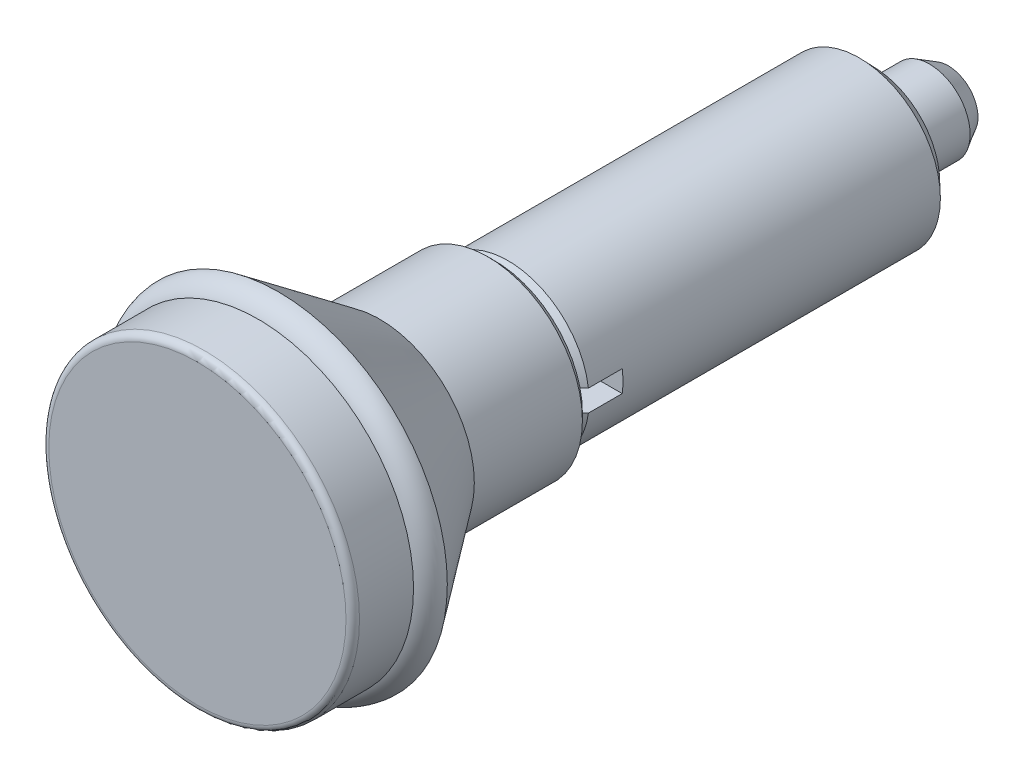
ISO-10303-21;
HEADER;
FILE_DESCRIPTION(('STEP AP214'),'2;1');
FILE_NAME('part.step','',(''),(''),'','','');
FILE_SCHEMA(('AUTOMOTIVE_DESIGN { 1 0 10303 214 1 1 1 1 }'));
ENDSEC;
DATA;
#1=APPLICATION_CONTEXT('core data for automotive mechanical design processes');
#2=APPLICATION_PROTOCOL_DEFINITION('international standard','automotive_design',2000,#1);
#3=PRODUCT_CONTEXT('',#1,'mechanical');
#4=PRODUCT('Part','Part','',(#3));
#5=PRODUCT_RELATED_PRODUCT_CATEGORY('part','',(#4));
#6=PRODUCT_DEFINITION_FORMATION('','',#4);
#7=PRODUCT_DEFINITION_CONTEXT('part definition',#1,'design');
#8=PRODUCT_DEFINITION('design','',#6,#7);
#9=PRODUCT_DEFINITION_SHAPE('','',#8);
#10=(LENGTH_UNIT() NAMED_UNIT(*) SI_UNIT(.MILLI.,.METRE.));
#11=(NAMED_UNIT(*) PLANE_ANGLE_UNIT() SI_UNIT($,.RADIAN.));
#12=(NAMED_UNIT(*) SI_UNIT($,.STERADIAN.) SOLID_ANGLE_UNIT());
#13=UNCERTAINTY_MEASURE_WITH_UNIT(LENGTH_MEASURE(1.E-05),#10,'distance_accuracy_value','');
#14=(GEOMETRIC_REPRESENTATION_CONTEXT(3) GLOBAL_UNCERTAINTY_ASSIGNED_CONTEXT((#13)) GLOBAL_UNIT_ASSIGNED_CONTEXT((#10,
#11,#12)) REPRESENTATION_CONTEXT('',''));
#15=CARTESIAN_POINT('',(0.,0.,0.));
#16=DIRECTION('',(0.,0.,1.));
#17=DIRECTION('',(1.,0.,0.));
#18=AXIS2_PLACEMENT_3D('',#15,#16,#17);
#19=CARTESIAN_POINT('',(0.,0.,28.000000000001));
#20=DIRECTION('',(0.,0.,-1.));
#21=DIRECTION('',(-1.,0.,0.));
#22=AXIS2_PLACEMENT_3D('',#19,#20,#21);
#23=CONICAL_SURFACE('',#22,5.00000000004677,0.785398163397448);
#24=CARTESIAN_POINT('',(0.,0.,28.000000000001));
#25=DIRECTION('',(0.,0.,1.));
#26=DIRECTION('',(1.,0.,0.));
#27=AXIS2_PLACEMENT_3D('',#24,#25,#26);
#28=CIRCLE('',#27,5.00000000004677);
#29=CARTESIAN_POINT('',(4.93558507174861,0.8,28.000000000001));
#30=VERTEX_POINT('',#29);
#31=CARTESIAN_POINT('',(-4.9355850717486,0.8,28.000000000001));
#32=VERTEX_POINT('',#31);
#33=EDGE_CURVE('E267',#30,#32,#28,.T.);
#34=ORIENTED_EDGE('',*,*,#33,.F.);
#35=CARTESIAN_POINT('',(2.54887657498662,0.8,30.3285262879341));
#36=CARTESIAN_POINT('',(2.64323235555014,0.8,30.238488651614));
#37=CARTESIAN_POINT('',(2.73737648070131,0.8,30.1482300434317));
#38=CARTESIAN_POINT('',(2.92532861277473,0.8,29.9673643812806));
#39=CARTESIAN_POINT('',(3.01913662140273,0.8,29.8767573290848));
#40=CARTESIAN_POINT('',(3.30018644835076,0.8,29.6045545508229));
#41=CARTESIAN_POINT('',(3.48705632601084,0.8,29.422575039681));
#42=CARTESIAN_POINT('',(3.86017892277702,0.8,29.0579924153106));
#43=CARTESIAN_POINT('',(4.0464316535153,0.8,28.875389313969));
#44=CARTESIAN_POINT('',(4.41852831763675,0.8,28.5097660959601));
#45=CARTESIAN_POINT('',(4.60437224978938,0.8,28.3267459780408));
#46=CARTESIAN_POINT('',(4.94561555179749,0.8,27.9901635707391));
#47=CARTESIAN_POINT('',(5.10105752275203,0.8,27.836644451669));
#48=CARTESIAN_POINT('',(5.41178870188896,0.8,27.5294505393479));
#49=CARTESIAN_POINT('',(5.56707790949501,0.8,27.3757757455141));
#50=CARTESIAN_POINT('',(5.98524723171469,0.8,26.9616350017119));
#51=CARTESIAN_POINT('',(6.24801670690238,0.8,26.701057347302));
#52=CARTESIAN_POINT('',(6.77332471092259,0.8,26.1796693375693));
#53=CARTESIAN_POINT('',(7.03586323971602,0.8,25.918858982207));
#54=CARTESIAN_POINT('',(7.56077213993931,0.8,25.3970760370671));
#55=CARTESIAN_POINT('',(7.82314251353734,0.8,25.1361034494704));
#56=CARTESIAN_POINT('',(8.34775880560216,0.8,24.6140334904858));
#57=CARTESIAN_POINT('',(8.61000472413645,0.8,24.3529361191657));
#58=CARTESIAN_POINT('',(8.87220867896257,0.8,24.0917966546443));
#59=B_SPLINE_CURVE_WITH_KNOTS('',3,(#35,#36,#37,#38,#39,#40,#41,#42,#43,#44,#45,#46,#47,#48,#49,
#50,#51,#52,#53,#54,#55,#56,#57,#58),.UNSPECIFIED.,.F.,.F.,(4,2,2,2,2,2,2,2,2,2,2,4),(0.,
0.3912635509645,0.782525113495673,1.56503885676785,2.34753776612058,3.13003902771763,
3.78545704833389,4.44087753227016,5.5510739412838,6.66127053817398,7.77145252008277,
8.88163389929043),.UNSPECIFIED.);
#60=CARTESIAN_POINT('',(5.94642749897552,0.8,27.));
#61=VERTEX_POINT('',#60);
#62=EDGE_CURVE('E150',#30,#61,#59,.T.);
#63=ORIENTED_EDGE('',*,*,#62,.T.);
#64=CARTESIAN_POINT('',(0.,0.,27.));
#65=DIRECTION('',(0.,0.,1.));
#66=DIRECTION('',(1.,0.,0.));
#67=AXIS2_PLACEMENT_3D('',#64,#65,#66);
#68=CIRCLE('',#67,6.00000000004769);
#69=CARTESIAN_POINT('',(-5.94642749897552,0.8,27.));
#70=VERTEX_POINT('',#69);
#71=EDGE_CURVE('E275',#61,#70,#68,.T.);
#72=ORIENTED_EDGE('',*,*,#71,.T.);
#73=CARTESIAN_POINT('',(-8.11888573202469,0.8,24.8417952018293));
#74=CARTESIAN_POINT('',(-7.8565688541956,0.8,25.1028399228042));
#75=CARTESIAN_POINT('',(-7.59419859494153,0.8,25.3638310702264));
#76=CARTESIAN_POINT('',(-7.06929360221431,0.8,25.8856433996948));
#77=CARTESIAN_POINT('',(-6.80675887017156,0.8,26.1464645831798));
#78=CARTESIAN_POINT('',(-6.28147458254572,0.8,26.6678668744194));
#79=CARTESIAN_POINT('',(-6.01872503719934,0.8,26.9284479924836));
#80=CARTESIAN_POINT('',(-5.49289054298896,0.8,27.4492762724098));
#81=CARTESIAN_POINT('',(-5.22980559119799,0.8,27.7095234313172));
#82=CARTESIAN_POINT('',(-4.70310752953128,0.8,28.229524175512));
#83=CARTESIAN_POINT('',(-4.43949438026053,0.8,28.4892777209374));
#84=CARTESIAN_POINT('',(-4.04343825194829,0.8,28.8782542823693));
#85=CARTESIAN_POINT('',(-3.91131496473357,0.8,29.0078027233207));
#86=CARTESIAN_POINT('',(-3.64677857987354,0.8,29.2666048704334));
#87=CARTESIAN_POINT('',(-3.51436548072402,0.8,29.3958585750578));
#88=CARTESIAN_POINT('',(-3.24913207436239,0.8,29.6539688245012));
#89=CARTESIAN_POINT('',(-3.11631173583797,0.8,29.7828253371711));
#90=CARTESIAN_POINT('',(-2.85010458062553,0.8,30.0399484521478));
#91=CARTESIAN_POINT('',(-2.71671777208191,0.8,30.1682150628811));
#92=CARTESIAN_POINT('',(-2.44908523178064,0.8,30.4238721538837));
#93=CARTESIAN_POINT('',(-2.31483943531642,0.8,30.551262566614));
#94=CARTESIAN_POINT('',(-2.11244551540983,0.8,30.7412639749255));
#95=CARTESIAN_POINT('',(-2.04480835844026,0.8,30.8044185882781));
#96=CARTESIAN_POINT('',(-1.90907423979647,0.8,30.9302341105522));
#97=CARTESIAN_POINT('',(-1.84097726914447,0.8,30.992895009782));
#98=CARTESIAN_POINT('',(-1.77259215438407,0.8,31.0552421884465));
#99=B_SPLINE_CURVE_WITH_KNOTS('',3,(#73,#74,#75,#76,#77,#78,#79,#80,#81,#82,#83,#84,#85,#86,#87,
#88,#89,#90,#91,#92,#93,#94,#95,#96,#97,#98),.UNSPECIFIED.,.F.,.F.,(4,2,2,2,2,2,2,2,2,2,2,2,4),
(0.,1.11022094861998,2.22043237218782,3.33059365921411,4.4407647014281,5.55102187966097,
6.10613798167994,6.6612569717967,7.21641977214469,7.77157461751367,8.32677178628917,
8.60438378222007,8.88200121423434),.UNSPECIFIED.);
#100=EDGE_CURVE('E177',#70,#32,#99,.T.);
#101=ORIENTED_EDGE('',*,*,#100,.T.);
#102=EDGE_LOOP('',(#34,#63,#72,#101));
#103=FACE_BOUND('',#102,.T.);
#104=ADVANCED_FACE('F14',(#103),#23,.T.);
#105=CARTESIAN_POINT('',(-5.94642749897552,-0.8,27.));
#106=VERTEX_POINT('',#105);
#107=CARTESIAN_POINT('',(5.94642749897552,-0.8,27.));
#108=VERTEX_POINT('',#107);
#109=EDGE_CURVE('E271',#106,#108,#68,.T.);
#110=ORIENTED_EDGE('',*,*,#109,.T.);
#111=CARTESIAN_POINT('',(8.87220867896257,-0.8,24.0917966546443));
#112=CARTESIAN_POINT('',(8.6100007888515,-0.8,24.3529400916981));
#113=CARTESIAN_POINT('',(8.34775089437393,-0.8,24.614041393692));
#114=CARTESIAN_POINT('',(7.8231272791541,-0.8,25.1361185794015));
#115=CARTESIAN_POINT('',(7.56075355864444,-0.8,25.3970944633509));
#116=CARTESIAN_POINT('',(7.03584531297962,-0.8,25.9188768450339));
#117=CARTESIAN_POINT('',(6.77331079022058,-0.8,26.1796833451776));
#118=CARTESIAN_POINT('',(6.24800990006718,-0.8,26.7010639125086));
#119=CARTESIAN_POINT('',(5.98524353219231,-0.8,26.961637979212));
#120=CARTESIAN_POINT('',(5.45936650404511,-0.8,27.4824501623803));
#121=CARTESIAN_POINT('',(5.19625583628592,-0.8,27.7426882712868));
#122=CARTESIAN_POINT('',(4.66951762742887,-0.8,28.2626388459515));
#123=CARTESIAN_POINT('',(4.40589008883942,-0.8,28.5223513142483));
#124=CARTESIAN_POINT('',(4.00979232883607,-0.8,28.911257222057));
#125=CARTESIAN_POINT('',(3.87764893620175,-0.8,29.0407834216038));
#126=CARTESIAN_POINT('',(3.61306442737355,-0.8,29.2995307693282));
#127=CARTESIAN_POINT('',(3.48062331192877,-0.8,29.4287519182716));
#128=CARTESIAN_POINT('',(3.21533565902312,-0.8,29.6867824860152));
#129=CARTESIAN_POINT('',(3.08248911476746,-0.8,29.8155918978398));
#130=CARTESIAN_POINT('',(2.81618874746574,-0.8,30.0725834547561));
#131=CARTESIAN_POINT('',(2.68273491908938,-0.8,30.2007655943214));
#132=CARTESIAN_POINT('',(2.54887657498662,-0.8,30.3285262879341));
#133=B_SPLINE_CURVE_WITH_KNOTS('',3,(#111,#112,#113,#114,#115,#116,#117,#118,#119,#120,#121,
#122,#123,#124,#125,#126,#127,#128,#129,#130,#131,#132),.UNSPECIFIED.,.F.,.F.,(4,2,2,2,2,2,2,2,
2,2,4),(0.,1.11019815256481,2.22039422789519,3.33057414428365,4.44075636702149,5.55096314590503,
6.66116455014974,7.2162769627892,7.77138798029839,8.32650835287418,8.88163360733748),.UNSPECIFIED.);
#134=CARTESIAN_POINT('',(4.93558507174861,-0.8,28.000000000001));
#135=VERTEX_POINT('',#134);
#136=EDGE_CURVE('E126',#108,#135,#133,.T.);
#137=ORIENTED_EDGE('',*,*,#136,.T.);
#138=CARTESIAN_POINT('',(-4.9355850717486,-0.8,28.000000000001));
#139=VERTEX_POINT('',#138);
#140=EDGE_CURVE('E99',#139,#135,#28,.T.);
#141=ORIENTED_EDGE('',*,*,#140,.F.);
#142=CARTESIAN_POINT('',(-1.7725921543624,-0.8,31.0552421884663));
#143=CARTESIAN_POINT('',(-1.84277101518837,-0.8,30.991256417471));
#144=CARTESIAN_POINT('',(-1.91264876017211,-0.8,30.9269427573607));
#145=CARTESIAN_POINT('',(-2.05192324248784,-0.8,30.7977992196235));
#146=CARTESIAN_POINT('',(-2.12131998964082,-0.8,30.7329693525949));
#147=CARTESIAN_POINT('',(-2.25975310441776,-0.8,30.6029335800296));
#148=CARTESIAN_POINT('',(-2.32878948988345,-0.8,30.5377276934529));
#149=CARTESIAN_POINT('',(-2.46658152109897,-0.8,30.4070192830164));
#150=CARTESIAN_POINT('',(-2.53533716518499,-0.8,30.3415167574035));
#151=CARTESIAN_POINT('',(-2.74126225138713,-0.8,30.1446746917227));
#152=CARTESIAN_POINT('',(-2.87810141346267,-0.8,30.0129897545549));
#153=CARTESIAN_POINT('',(-3.15120327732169,-0.8,29.7490205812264));
#154=CARTESIAN_POINT('',(-3.28746597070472,-0.8,29.6167363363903));
#155=CARTESIAN_POINT('',(-3.5526152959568,-0.8,29.3585423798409));
#156=CARTESIAN_POINT('',(-3.68152209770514,-0.8,29.2326533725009));
#157=CARTESIAN_POINT('',(-3.93906728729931,-0.8,28.9806025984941));
#158=CARTESIAN_POINT('',(-4.06770567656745,-0.8,28.85444083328));
#159=CARTESIAN_POINT('',(-4.45333141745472,-0.8,28.4756415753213));
#160=CARTESIAN_POINT('',(-4.71001962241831,-0.8,28.2226996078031));
#161=CARTESIAN_POINT('',(-5.22982209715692,-0.8,27.709507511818));
#162=CARTESIAN_POINT('',(-5.49292320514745,-0.8,27.4492440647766));
#163=CARTESIAN_POINT('',(-6.0187924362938,-0.8,26.9283810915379));
#164=CARTESIAN_POINT('',(-6.28156055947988,-0.8,26.6677815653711));
#165=CARTESIAN_POINT('',(-6.80684718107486,-0.8,26.1463768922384));
#166=CARTESIAN_POINT('',(-7.06936569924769,-0.8,25.8855717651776));
#167=CARTESIAN_POINT('',(-7.59423584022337,-0.8,25.3637940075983));
#168=CARTESIAN_POINT('',(-7.85658746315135,-0.8,25.1028213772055));
#169=CARTESIAN_POINT('',(-8.11888573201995,-0.8,24.8417952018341));
#170=B_SPLINE_CURVE_WITH_KNOTS('',3,(#142,#143,#144,#145,#146,#147,#148,#149,#150,#151,#152,
#153,#154,#155,#156,#157,#158,#159,#160,#161,#162,#163,#164,#165,#166,#167,#168,#169),
.UNSPECIFIED.,.F.,.F.,(4,2,2,2,2,2,2,2,2,2,2,2,2,4),(0.,0.284905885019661,0.569805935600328,
0.854691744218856,1.13957923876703,1.70930653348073,2.27904210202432,2.81958297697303,
3.3601209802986,4.4412377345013,5.55147758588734,6.66171733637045,7.77186030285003,
8.88200243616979),.UNSPECIFIED.);
#171=EDGE_CURVE('E184',#139,#106,#170,.T.);
#172=ORIENTED_EDGE('',*,*,#171,.T.);
#173=EDGE_LOOP('',(#110,#137,#141,#172));
#174=FACE_BOUND('',#173,.T.);
#175=ADVANCED_FACE('F249',(#174),#23,.T.);
#176=CARTESIAN_POINT('',(0.,0.,50.0000000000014));
#177=DIRECTION('',(0.,0.,1.));
#178=DIRECTION('',(1.,0.,0.));
#179=AXIS2_PLACEMENT_3D('',#176,#177,#178);
#180=CYLINDRICAL_SURFACE('',#179,6.00000000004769);
#181=CARTESIAN_POINT('',(0.,0.,1.));
#182=DIRECTION('',(0.,0.,1.));
#183=DIRECTION('',(1.,0.,0.));
#184=AXIS2_PLACEMENT_3D('',#181,#182,#183);
#185=CIRCLE('',#184,6.00000000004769);
#186=CARTESIAN_POINT('',(6.00000000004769,0.,1.));
#187=VERTEX_POINT('',#186);
#188=EDGE_CURVE('E320',#187,#187,#185,.T.);
#189=ORIENTED_EDGE('',*,*,#188,.T.);
#190=EDGE_LOOP('',(#189));
#191=FACE_BOUND('',#190,.T.);
#192=ORIENTED_EDGE('',*,*,#71,.F.);
#193=DIRECTION('',(0.,0.,1.));
#194=VECTOR('',#193,1.);
#195=CARTESIAN_POINT('',(5.94642749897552,0.8,50.0000000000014));
#196=LINE('',#195,#194);
#197=CARTESIAN_POINT('',(5.94642749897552,0.8,24.500000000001));
#198=VERTEX_POINT('',#197);
#199=EDGE_CURVE('E134',#61,#198,#196,.F.);
#200=ORIENTED_EDGE('',*,*,#199,.T.);
#201=CARTESIAN_POINT('',(0.,0.,24.500000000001));
#202=DIRECTION('',(0.,0.,-1.));
#203=DIRECTION('',(-1.,0.,0.));
#204=AXIS2_PLACEMENT_3D('',#201,#202,#203);
#205=CIRCLE('',#204,6.00000000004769);
#206=CARTESIAN_POINT('',(5.94642749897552,-0.8,24.500000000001));
#207=VERTEX_POINT('',#206);
#208=EDGE_CURVE('E9',#207,#198,#205,.F.);
#209=ORIENTED_EDGE('',*,*,#208,.F.);
#210=DIRECTION('',(0.,0.,1.));
#211=VECTOR('',#210,1.);
#212=CARTESIAN_POINT('',(5.94642749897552,-0.8,50.0000000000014));
#213=LINE('',#212,#211);
#214=EDGE_CURVE('E108',#207,#108,#213,.T.);
#215=ORIENTED_EDGE('',*,*,#214,.T.);
#216=ORIENTED_EDGE('',*,*,#109,.F.);
#217=DIRECTION('',(0.,0.,1.));
#218=VECTOR('',#217,1.);
#219=CARTESIAN_POINT('',(-5.94642749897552,-0.8,50.0000000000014));
#220=LINE('',#219,#218);
#221=CARTESIAN_POINT('',(-5.94642749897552,-0.8,24.500000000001));
#222=VERTEX_POINT('',#221);
#223=EDGE_CURVE('E22',#106,#222,#220,.F.);
#224=ORIENTED_EDGE('',*,*,#223,.T.);
#225=CARTESIAN_POINT('',(0.,0.,24.500000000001));
#226=DIRECTION('',(0.,0.,-1.));
#227=DIRECTION('',(-1.,0.,0.));
#228=AXIS2_PLACEMENT_3D('',#225,#226,#227);
#229=CIRCLE('',#228,6.00000000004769);
#230=CARTESIAN_POINT('',(-5.94642749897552,0.8,24.500000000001));
#231=VERTEX_POINT('',#230);
#232=EDGE_CURVE('E281',#231,#222,#229,.F.);
#233=ORIENTED_EDGE('',*,*,#232,.F.);
#234=DIRECTION('',(0.,0.,1.));
#235=VECTOR('',#234,1.);
#236=CARTESIAN_POINT('',(-5.94642749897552,0.8,50.0000000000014));
#237=LINE('',#236,#235);
#238=EDGE_CURVE('E283',#231,#70,#237,.T.);
#239=ORIENTED_EDGE('',*,*,#238,.T.);
#240=EDGE_LOOP('',(#192,#200,#209,#215,#216,#224,#233,#239));
#241=FACE_BOUND('',#240,.T.);
#242=ADVANCED_FACE('F247',(#191,#241),#180,.T.);
#243=CARTESIAN_POINT('',(0.,0.,28.5000000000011));
#244=DIRECTION('',(0.,0.,1.));
#245=DIRECTION('',(1.,0.,0.));
#246=AXIS2_PLACEMENT_3D('',#243,#244,#245);
#247=CONICAL_SURFACE('',#246,7.,0.785398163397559);
#248=CARTESIAN_POINT('',(0.,0.,28.000000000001));
#249=DIRECTION('',(0.,0.,1.));
#250=DIRECTION('',(1.,0.,0.));
#251=AXIS2_PLACEMENT_3D('',#248,#249,#250);
#252=CIRCLE('',#251,6.49999999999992);
#253=CARTESIAN_POINT('',(6.49999999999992,0.,28.000000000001));
#254=VERTEX_POINT('',#253);
#255=EDGE_CURVE('E273',#254,#254,#252,.T.);
#256=ORIENTED_EDGE('',*,*,#255,.T.);
#257=EDGE_LOOP('',(#256));
#258=FACE_BOUND('',#257,.T.);
#259=CARTESIAN_POINT('',(0.,0.,28.5000000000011));
#260=DIRECTION('',(0.,0.,1.));
#261=DIRECTION('',(1.,0.,0.));
#262=AXIS2_PLACEMENT_3D('',#259,#260,#261);
#263=CIRCLE('',#262,7.);
#264=CARTESIAN_POINT('',(7.,0.,28.5000000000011));
#265=VERTEX_POINT('',#264);
#266=EDGE_CURVE('E290',#265,#265,#263,.T.);
#267=ORIENTED_EDGE('',*,*,#266,.F.);
#268=EDGE_LOOP('',(#267));
#269=FACE_BOUND('',#268,.T.);
#270=ADVANCED_FACE('F16',(#258,#269),#247,.T.);
#271=CARTESIAN_POINT('',(0.,6.49999999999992,28.000000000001));
#272=DIRECTION('',(0.,0.,-1.));
#273=DIRECTION('',(-1.,0.,0.));
#274=AXIS2_PLACEMENT_3D('',#271,#272,#273);
#275=PLANE('',#274);
#276=ORIENTED_EDGE('',*,*,#140,.T.);
#277=DIRECTION('',(-1.,0.,0.));
#278=VECTOR('',#277,1.);
#279=CARTESIAN_POINT('',(4.,-0.8,28.000000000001));
#280=LINE('',#279,#278);
#281=CARTESIAN_POINT('',(4.,-0.8,28.000000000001));
#282=VERTEX_POINT('',#281);
#283=EDGE_CURVE('E89',#135,#282,#280,.T.);
#284=ORIENTED_EDGE('',*,*,#283,.T.);
#285=DIRECTION('',(0.,1.,0.));
#286=VECTOR('',#285,1.);
#287=CARTESIAN_POINT('',(4.,0.8,28.000000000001));
#288=LINE('',#287,#286);
#289=CARTESIAN_POINT('',(4.,0.8,28.000000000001));
#290=VERTEX_POINT('',#289);
#291=EDGE_CURVE('E95',#282,#290,#288,.T.);
#292=ORIENTED_EDGE('',*,*,#291,.T.);
#293=DIRECTION('',(1.,0.,0.));
#294=VECTOR('',#293,1.);
#295=CARTESIAN_POINT('',(4.,0.8,28.000000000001));
#296=LINE('',#295,#294);
#297=EDGE_CURVE('E102',#290,#30,#296,.T.);
#298=ORIENTED_EDGE('',*,*,#297,.T.);
#299=ORIENTED_EDGE('',*,*,#33,.T.);
#300=DIRECTION('',(1.,0.,0.));
#301=VECTOR('',#300,1.);
#302=CARTESIAN_POINT('',(-4.,0.8,28.000000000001));
#303=LINE('',#302,#301);
#304=CARTESIAN_POINT('',(-4.,0.8,28.000000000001));
#305=VERTEX_POINT('',#304);
#306=EDGE_CURVE('E162',#32,#305,#303,.T.);
#307=ORIENTED_EDGE('',*,*,#306,.T.);
#308=DIRECTION('',(0.,-1.,0.));
#309=VECTOR('',#308,1.);
#310=CARTESIAN_POINT('',(-4.,0.8,28.000000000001));
#311=LINE('',#310,#309);
#312=CARTESIAN_POINT('',(-4.,-0.8,28.000000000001));
#313=VERTEX_POINT('',#312);
#314=EDGE_CURVE('E157',#305,#313,#311,.T.);
#315=ORIENTED_EDGE('',*,*,#314,.T.);
#316=DIRECTION('',(-1.,0.,0.));
#317=VECTOR('',#316,1.);
#318=CARTESIAN_POINT('',(-4.,-0.8,28.000000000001));
#319=LINE('',#318,#317);
#320=EDGE_CURVE('E160',#313,#139,#319,.T.);
#321=ORIENTED_EDGE('',*,*,#320,.T.);
#322=EDGE_LOOP('',(#276,#284,#292,#298,#299,#307,#315,#321));
#323=FACE_BOUND('',#322,.T.);
#324=ORIENTED_EDGE('',*,*,#255,.F.);
#325=EDGE_LOOP('',(#324));
#326=FACE_BOUND('',#325,.T.);
#327=ADVANCED_FACE('F91',(#323,#326),#275,.T.);
#328=CARTESIAN_POINT('',(0.,0.,1.));
#329=DIRECTION('',(0.,0.,1.));
#330=DIRECTION('',(1.,0.,0.));
#331=AXIS2_PLACEMENT_3D('',#328,#329,#330);
#332=CONICAL_SURFACE('',#331,6.00000000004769,0.809783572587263);
#333=CARTESIAN_POINT('',(0.,0.,0.));
#334=DIRECTION('',(0.,0.,1.));
#335=DIRECTION('',(1.,0.,0.));
#336=AXIS2_PLACEMENT_3D('',#333,#334,#335);
#337=CIRCLE('',#336,4.95000000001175);
#338=CARTESIAN_POINT('',(4.95000000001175,0.,0.));
#339=VERTEX_POINT('',#338);
#340=EDGE_CURVE('E318',#339,#339,#337,.T.);
#341=ORIENTED_EDGE('',*,*,#340,.T.);
#342=EDGE_LOOP('',(#341));
#343=FACE_BOUND('',#342,.T.);
#344=ORIENTED_EDGE('',*,*,#188,.F.);
#345=EDGE_LOOP('',(#344));
#346=FACE_BOUND('',#345,.T.);
#347=ADVANCED_FACE('F243',(#343,#346),#332,.T.);
#348=CARTESIAN_POINT('',(0.,4.95000000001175,0.));
#349=DIRECTION('',(0.,0.,-1.));
#350=DIRECTION('',(-1.,0.,0.));
#351=AXIS2_PLACEMENT_3D('',#348,#349,#350);
#352=PLANE('',#351);
#353=CARTESIAN_POINT('',(0.,0.,0.));
#354=DIRECTION('',(0.,0.,1.));
#355=DIRECTION('',(1.,0.,0.));
#356=AXIS2_PLACEMENT_3D('',#353,#354,#355);
#357=CIRCLE('',#356,3.0000000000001);
#358=CARTESIAN_POINT('',(3.0000000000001,0.,0.));
#359=VERTEX_POINT('',#358);
#360=EDGE_CURVE('E315',#359,#359,#357,.T.);
#361=ORIENTED_EDGE('',*,*,#360,.T.);
#362=EDGE_LOOP('',(#361));
#363=FACE_BOUND('',#362,.T.);
#364=ORIENTED_EDGE('',*,*,#340,.F.);
#365=EDGE_LOOP('',(#364));
#366=FACE_BOUND('',#365,.T.);
#367=ADVANCED_FACE('F239',(#363,#366),#352,.T.);
#368=CARTESIAN_POINT('',(0.,0.,50.0000000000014));
#369=DIRECTION('',(0.,0.,1.));
#370=DIRECTION('',(1.,0.,0.));
#371=AXIS2_PLACEMENT_3D('',#368,#369,#370);
#372=CYLINDRICAL_SURFACE('',#371,3.00000000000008);
#373=CARTESIAN_POINT('',(0.,0.,-4.19999999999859));
#374=DIRECTION('',(0.,0.,1.));
#375=DIRECTION('',(1.,0.,0.));
#376=AXIS2_PLACEMENT_3D('',#373,#374,#375);
#377=CIRCLE('',#376,3.00000000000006);
#378=CARTESIAN_POINT('',(3.00000000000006,0.,-4.19999999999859));
#379=VERTEX_POINT('',#378);
#380=EDGE_CURVE('E312',#379,#379,#377,.T.);
#381=ORIENTED_EDGE('',*,*,#380,.T.);
#382=EDGE_LOOP('',(#381));
#383=FACE_BOUND('',#382,.T.);
#384=ORIENTED_EDGE('',*,*,#360,.F.);
#385=EDGE_LOOP('',(#384));
#386=FACE_BOUND('',#385,.T.);
#387=ADVANCED_FACE('F235',(#383,#386),#372,.T.);
#388=CARTESIAN_POINT('',(0.,0.,-4.19999999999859));
#389=DIRECTION('',(0.,0.,1.));
#390=DIRECTION('',(1.,0.,0.));
#391=AXIS2_PLACEMENT_3D('',#388,#389,#390);
#392=CONICAL_SURFACE('',#391,3.00000000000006,0.523598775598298);
#393=CARTESIAN_POINT('',(0.,0.,-5.58107460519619));
#394=DIRECTION('',(0.,0.,1.));
#395=DIRECTION('',(1.,0.,0.));
#396=AXIS2_PLACEMENT_3D('',#393,#394,#395);
#397=CIRCLE('',#396,2.20263620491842);
#398=CARTESIAN_POINT('',(2.20263620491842,0.,-5.58107460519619));
#399=VERTEX_POINT('',#398);
#400=EDGE_CURVE('E309',#399,#399,#397,.T.);
#401=ORIENTED_EDGE('',*,*,#400,.T.);
#402=EDGE_LOOP('',(#401));
#403=FACE_BOUND('',#402,.T.);
#404=ORIENTED_EDGE('',*,*,#380,.F.);
#405=EDGE_LOOP('',(#404));
#406=FACE_BOUND('',#405,.T.);
#407=ADVANCED_FACE('F231',(#403,#406),#392,.T.);
#408=CARTESIAN_POINT('',(0.,0.,1.40165656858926E-12));
#409=DIRECTION('',(0.,0.,1.));
#410=DIRECTION('',(0.,1.,0.));
#411=AXIS2_PLACEMENT_3D('',#408,#409,#410);
#412=SPHERICAL_SURFACE('',#411,5.9999999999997);
#413=ORIENTED_EDGE('',*,*,#400,.F.);
#414=EDGE_LOOP('',(#413));
#415=FACE_BOUND('',#414,.T.);
#416=ADVANCED_FACE('F227',(#415),#412,.T.);
#417=CARTESIAN_POINT('',(0.,11.0000000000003,50.0000000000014));
#418=DIRECTION('',(0.,0.,1.));
#419=DIRECTION('',(1.,0.,0.));
#420=AXIS2_PLACEMENT_3D('',#417,#418,#419);
#421=PLANE('',#420);
#422=CARTESIAN_POINT('',(0.,0.,50.0000000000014));
#423=DIRECTION('',(0.,0.,1.));
#424=DIRECTION('',(1.,0.,0.));
#425=AXIS2_PLACEMENT_3D('',#422,#423,#424);
#426=CIRCLE('',#425,11.0000000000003);
#427=CARTESIAN_POINT('',(11.0000000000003,0.,50.0000000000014));
#428=VERTEX_POINT('',#427);
#429=EDGE_CURVE('E306',#428,#428,#426,.T.);
#430=ORIENTED_EDGE('',*,*,#429,.T.);
#431=EDGE_LOOP('',(#430));
#432=FACE_BOUND('',#431,.T.);
#433=ADVANCED_FACE('F223',(#432),#421,.T.);
#434=CARTESIAN_POINT('',(0.,0.,49.5000000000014));
#435=DIRECTION('',(0.,0.,1.));
#436=DIRECTION('',(1.,0.,0.));
#437=AXIS2_PLACEMENT_3D('',#434,#435,#436);
#438=TOROIDAL_SURFACE('',#437,11.0000000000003,0.5);
#439=CARTESIAN_POINT('',(0.,0.,49.5000000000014));
#440=DIRECTION('',(0.,0.,1.));
#441=DIRECTION('',(1.,0.,0.));
#442=AXIS2_PLACEMENT_3D('',#439,#440,#441);
#443=CIRCLE('',#442,11.5000000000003);
#444=CARTESIAN_POINT('',(11.5000000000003,0.,49.5000000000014));
#445=VERTEX_POINT('',#444);
#446=EDGE_CURVE('E303',#445,#445,#443,.T.);
#447=ORIENTED_EDGE('',*,*,#446,.T.);
#448=EDGE_LOOP('',(#447));
#449=FACE_BOUND('',#448,.T.);
#450=ORIENTED_EDGE('',*,*,#429,.F.);
#451=EDGE_LOOP('',(#450));
#452=FACE_BOUND('',#451,.T.);
#453=ADVANCED_FACE('F219',(#449,#452),#438,.T.);
#454=CARTESIAN_POINT('',(0.,0.,50.0000000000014));
#455=DIRECTION('',(0.,0.,1.));
#456=DIRECTION('',(1.,0.,0.));
#457=AXIS2_PLACEMENT_3D('',#454,#455,#456);
#458=CYLINDRICAL_SURFACE('',#457,11.5000000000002);
#459=CARTESIAN_POINT('',(0.,0.,45.5000000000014));
#460=DIRECTION('',(0.,0.,1.));
#461=DIRECTION('',(1.,0.,0.));
#462=AXIS2_PLACEMENT_3D('',#459,#460,#461);
#463=CIRCLE('',#462,11.5);
#464=CARTESIAN_POINT('',(11.5,0.,45.5000000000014));
#465=VERTEX_POINT('',#464);
#466=EDGE_CURVE('E300',#465,#465,#463,.T.);
#467=ORIENTED_EDGE('',*,*,#466,.T.);
#468=EDGE_LOOP('',(#467));
#469=FACE_BOUND('',#468,.T.);
#470=ORIENTED_EDGE('',*,*,#446,.F.);
#471=EDGE_LOOP('',(#470));
#472=FACE_BOUND('',#471,.T.);
#473=ADVANCED_FACE('F215',(#469,#472),#458,.T.);
#474=CARTESIAN_POINT('',(0.,0.,44.000000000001));
#475=DIRECTION('',(0.,0.,1.));
#476=DIRECTION('',(1.,0.,0.));
#477=AXIS2_PLACEMENT_3D('',#474,#475,#476);
#478=TOROIDAL_SURFACE('',#477,10.8749999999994,1.62500000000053);
#479=CARTESIAN_POINT('',(0.,0.,44.000000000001));
#480=DIRECTION('',(0.,0.,1.));
#481=DIRECTION('',(1.,0.,0.));
#482=AXIS2_PLACEMENT_3D('',#479,#480,#481);
#483=CIRCLE('',#482,12.5);
#484=CARTESIAN_POINT('',(12.5,0.,44.000000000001));
#485=VERTEX_POINT('',#484);
#486=EDGE_CURVE('E295',#485,#485,#483,.T.);
#487=ORIENTED_EDGE('',*,*,#486,.T.);
#488=EDGE_LOOP('',(#487));
#489=FACE_BOUND('',#488,.T.);
#490=ORIENTED_EDGE('',*,*,#466,.F.);
#491=EDGE_LOOP('',(#490));
#492=FACE_BOUND('',#491,.T.);
#493=ADVANCED_FACE('F211',(#489,#492),#478,.T.);
#494=CARTESIAN_POINT('',(0.,0.,44.000000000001));
#495=DIRECTION('',(0.,0.,1.));
#496=DIRECTION('',(1.,0.,0.));
#497=AXIS2_PLACEMENT_3D('',#494,#495,#496);
#498=CONICAL_SURFACE('',#497,12.5,0.63274883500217);
#499=CARTESIAN_POINT('',(0.,0.,36.500000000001));
#500=DIRECTION('',(0.,0.,1.));
#501=DIRECTION('',(1.,0.,0.));
#502=AXIS2_PLACEMENT_3D('',#499,#500,#501);
#503=CIRCLE('',#502,7.);
#504=CARTESIAN_POINT('',(7.,0.,36.500000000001));
#505=VERTEX_POINT('',#504);
#506=EDGE_CURVE('E292',#505,#505,#503,.T.);
#507=ORIENTED_EDGE('',*,*,#506,.T.);
#508=EDGE_LOOP('',(#507));
#509=FACE_BOUND('',#508,.T.);
#510=ORIENTED_EDGE('',*,*,#486,.F.);
#511=EDGE_LOOP('',(#510));
#512=FACE_BOUND('',#511,.T.);
#513=ADVANCED_FACE('F207',(#509,#512),#498,.T.);
#514=CARTESIAN_POINT('',(0.,0.,50.0000000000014));
#515=DIRECTION('',(0.,0.,1.));
#516=DIRECTION('',(1.,0.,0.));
#517=AXIS2_PLACEMENT_3D('',#514,#515,#516);
#518=CYLINDRICAL_SURFACE('',#517,7.);
#519=ORIENTED_EDGE('',*,*,#266,.T.);
#520=EDGE_LOOP('',(#519));
#521=FACE_BOUND('',#520,.T.);
#522=ORIENTED_EDGE('',*,*,#506,.F.);
#523=EDGE_LOOP('',(#522));
#524=FACE_BOUND('',#523,.T.);
#525=ADVANCED_FACE('F203',(#521,#524),#518,.T.);
#526=CARTESIAN_POINT('',(-4.,0.8,24.500000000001));
#527=DIRECTION('',(-1.,0.,0.));
#528=DIRECTION('',(0.,0.,1.));
#529=AXIS2_PLACEMENT_3D('',#526,#527,#528);
#530=PLANE('',#529);
#531=ORIENTED_EDGE('',*,*,#314,.F.);
#532=DIRECTION('',(0.,0.,1.));
#533=VECTOR('',#532,1.);
#534=CARTESIAN_POINT('',(-4.,0.8,24.500000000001));
#535=LINE('',#534,#533);
#536=CARTESIAN_POINT('',(-4.,0.8,24.500000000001));
#537=VERTEX_POINT('',#536);
#538=EDGE_CURVE('E171',#537,#305,#535,.T.);
#539=ORIENTED_EDGE('',*,*,#538,.F.);
#540=DIRECTION('',(0.,-1.,0.));
#541=VECTOR('',#540,1.);
#542=CARTESIAN_POINT('',(-4.,0.8,24.500000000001));
#543=LINE('',#542,#541);
#544=CARTESIAN_POINT('',(-4.,-0.8,24.500000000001));
#545=VERTEX_POINT('',#544);
#546=EDGE_CURVE('E164',#537,#545,#543,.T.);
#547=ORIENTED_EDGE('',*,*,#546,.T.);
#548=DIRECTION('',(0.,0.,1.));
#549=VECTOR('',#548,1.);
#550=CARTESIAN_POINT('',(-4.,-0.8,24.500000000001));
#551=LINE('',#550,#549);
#552=EDGE_CURVE('E174',#545,#313,#551,.T.);
#553=ORIENTED_EDGE('',*,*,#552,.T.);
#554=EDGE_LOOP('',(#531,#539,#547,#553));
#555=FACE_BOUND('',#554,.T.);
#556=ADVANCED_FACE('F199',(#555),#530,.T.);
#557=CARTESIAN_POINT('',(-4.,-0.8,24.500000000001));
#558=DIRECTION('',(0.,1.,0.));
#559=DIRECTION('',(-1.,0.,0.));
#560=AXIS2_PLACEMENT_3D('',#557,#558,#559);
#561=PLANE('',#560);
#562=ORIENTED_EDGE('',*,*,#320,.F.);
#563=ORIENTED_EDGE('',*,*,#552,.F.);
#564=DIRECTION('',(-1.,0.,0.));
#565=VECTOR('',#564,1.);
#566=CARTESIAN_POINT('',(-4.,-0.8,24.500000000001));
#567=LINE('',#566,#565);
#568=EDGE_CURVE('E167',#545,#222,#567,.T.);
#569=ORIENTED_EDGE('',*,*,#568,.T.);
#570=ORIENTED_EDGE('',*,*,#223,.F.);
#571=ORIENTED_EDGE('',*,*,#171,.F.);
#572=EDGE_LOOP('',(#562,#563,#569,#570,#571));
#573=FACE_BOUND('',#572,.T.);
#574=ADVANCED_FACE('F194',(#573),#561,.T.);
#575=CARTESIAN_POINT('',(-4.,0.8,24.500000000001));
#576=DIRECTION('',(0.,-1.,0.));
#577=DIRECTION('',(1.,0.,0.));
#578=AXIS2_PLACEMENT_3D('',#575,#576,#577);
#579=PLANE('',#578);
#580=ORIENTED_EDGE('',*,*,#238,.F.);
#581=DIRECTION('',(1.,0.,0.));
#582=VECTOR('',#581,1.);
#583=CARTESIAN_POINT('',(-4.,0.8,24.500000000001));
#584=LINE('',#583,#582);
#585=EDGE_CURVE('E36',#231,#537,#584,.T.);
#586=ORIENTED_EDGE('',*,*,#585,.T.);
#587=ORIENTED_EDGE('',*,*,#538,.T.);
#588=ORIENTED_EDGE('',*,*,#306,.F.);
#589=ORIENTED_EDGE('',*,*,#100,.F.);
#590=EDGE_LOOP('',(#580,#586,#587,#588,#589));
#591=FACE_BOUND('',#590,.T.);
#592=ADVANCED_FACE('F191',(#591),#579,.T.);
#593=CARTESIAN_POINT('',(-4.,0.8,24.500000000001));
#594=DIRECTION('',(0.,0.,-1.));
#595=DIRECTION('',(-1.,0.,0.));
#596=AXIS2_PLACEMENT_3D('',#593,#594,#595);
#597=PLANE('',#596);
#598=ORIENTED_EDGE('',*,*,#232,.T.);
#599=ORIENTED_EDGE('',*,*,#568,.F.);
#600=ORIENTED_EDGE('',*,*,#546,.F.);
#601=ORIENTED_EDGE('',*,*,#585,.F.);
#602=EDGE_LOOP('',(#598,#599,#600,#601));
#603=FACE_BOUND('',#602,.T.);
#604=ADVANCED_FACE('F147',(#603),#597,.F.);
#605=CARTESIAN_POINT('',(4.,0.8,24.500000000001));
#606=DIRECTION('',(0.,-1.,0.));
#607=DIRECTION('',(1.,0.,0.));
#608=AXIS2_PLACEMENT_3D('',#605,#606,#607);
#609=PLANE('',#608);
#610=ORIENTED_EDGE('',*,*,#297,.F.);
#611=DIRECTION('',(0.,0.,1.));
#612=VECTOR('',#611,1.);
#613=CARTESIAN_POINT('',(4.,0.8,24.500000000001));
#614=LINE('',#613,#612);
#615=CARTESIAN_POINT('',(4.,0.8,24.500000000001));
#616=VERTEX_POINT('',#615);
#617=EDGE_CURVE('E109',#616,#290,#614,.T.);
#618=ORIENTED_EDGE('',*,*,#617,.F.);
#619=DIRECTION('',(1.,0.,0.));
#620=VECTOR('',#619,1.);
#621=CARTESIAN_POINT('',(4.,0.8,24.500000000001));
#622=LINE('',#621,#620);
#623=EDGE_CURVE('E114',#616,#198,#622,.T.);
#624=ORIENTED_EDGE('',*,*,#623,.T.);
#625=ORIENTED_EDGE('',*,*,#199,.F.);
#626=ORIENTED_EDGE('',*,*,#62,.F.);
#627=EDGE_LOOP('',(#610,#618,#624,#625,#626));
#628=FACE_BOUND('',#627,.T.);
#629=ADVANCED_FACE('F142',(#628),#609,.T.);
#630=CARTESIAN_POINT('',(4.,-0.8,24.500000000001));
#631=DIRECTION('',(0.,1.,0.));
#632=DIRECTION('',(-1.,0.,0.));
#633=AXIS2_PLACEMENT_3D('',#630,#631,#632);
#634=PLANE('',#633);
#635=ORIENTED_EDGE('',*,*,#214,.F.);
#636=DIRECTION('',(-1.,0.,0.));
#637=VECTOR('',#636,1.);
#638=CARTESIAN_POINT('',(4.,-0.8,24.500000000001));
#639=LINE('',#638,#637);
#640=CARTESIAN_POINT('',(4.,-0.8,24.500000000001));
#641=VERTEX_POINT('',#640);
#642=EDGE_CURVE('E28',#207,#641,#639,.T.);
#643=ORIENTED_EDGE('',*,*,#642,.T.);
#644=DIRECTION('',(0.,0.,1.));
#645=VECTOR('',#644,1.);
#646=CARTESIAN_POINT('',(4.,-0.8,24.500000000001));
#647=LINE('',#646,#645);
#648=EDGE_CURVE('E105',#641,#282,#647,.T.);
#649=ORIENTED_EDGE('',*,*,#648,.T.);
#650=ORIENTED_EDGE('',*,*,#283,.F.);
#651=ORIENTED_EDGE('',*,*,#136,.F.);
#652=EDGE_LOOP('',(#635,#643,#649,#650,#651));
#653=FACE_BOUND('',#652,.T.);
#654=ADVANCED_FACE('F106',(#653),#634,.T.);
#655=CARTESIAN_POINT('',(4.,0.8,24.500000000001));
#656=DIRECTION('',(1.,0.,0.));
#657=DIRECTION('',(0.,0.,-1.));
#658=AXIS2_PLACEMENT_3D('',#655,#656,#657);
#659=PLANE('',#658);
#660=ORIENTED_EDGE('',*,*,#291,.F.);
#661=ORIENTED_EDGE('',*,*,#648,.F.);
#662=DIRECTION('',(0.,1.,0.));
#663=VECTOR('',#662,1.);
#664=CARTESIAN_POINT('',(4.,0.8,24.500000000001));
#665=LINE('',#664,#663);
#666=EDGE_CURVE('E121',#641,#616,#665,.T.);
#667=ORIENTED_EDGE('',*,*,#666,.T.);
#668=ORIENTED_EDGE('',*,*,#617,.T.);
#669=EDGE_LOOP('',(#660,#661,#667,#668));
#670=FACE_BOUND('',#669,.T.);
#671=ADVANCED_FACE('F111',(#670),#659,.T.);
#672=CARTESIAN_POINT('',(15.8653091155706,0.8,24.500000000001));
#673=DIRECTION('',(0.,0.,-1.));
#674=DIRECTION('',(-1.,0.,0.));
#675=AXIS2_PLACEMENT_3D('',#672,#673,#674);
#676=PLANE('',#675);
#677=ORIENTED_EDGE('',*,*,#208,.T.);
#678=ORIENTED_EDGE('',*,*,#623,.F.);
#679=ORIENTED_EDGE('',*,*,#666,.F.);
#680=ORIENTED_EDGE('',*,*,#642,.F.);
#681=EDGE_LOOP('',(#677,#678,#679,#680));
#682=FACE_BOUND('',#681,.T.);
#683=ADVANCED_FACE('F352',(#682),#676,.F.);
#684=CLOSED_SHELL('',(#104,#175,#242,#270,#327,#347,#367,#387,#407,#416,#433,#453,#473,#493,
#513,#525,#556,#574,#592,#604,#629,#654,#671,#683));
#685=MANIFOLD_SOLID_BREP('B1',#684);
#686=ADVANCED_BREP_SHAPE_REPRESENTATION('',(#18,#685),#14);
#687=SHAPE_DEFINITION_REPRESENTATION(#9,#686);
ENDSEC;
END-ISO-10303-21;
